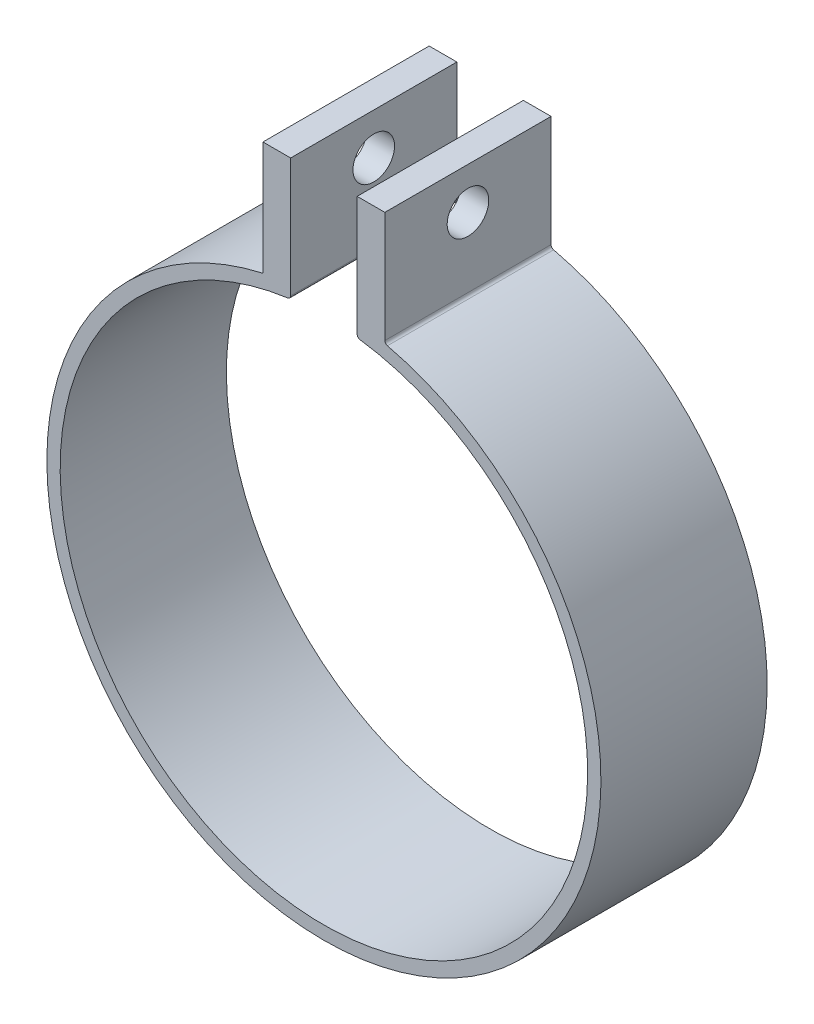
ISO-10303-21;
HEADER;
FILE_DESCRIPTION(('STEP AP214'),'2;1');
FILE_NAME('part.step','',(''),(''),'','','');
FILE_SCHEMA(('AUTOMOTIVE_DESIGN { 1 0 10303 214 1 1 1 1 }'));
ENDSEC;
DATA;
#1=APPLICATION_CONTEXT('core data for automotive mechanical design processes');
#2=APPLICATION_PROTOCOL_DEFINITION('international standard','automotive_design',2000,#1);
#3=PRODUCT_CONTEXT('',#1,'mechanical');
#4=PRODUCT('Part','Part','',(#3));
#5=PRODUCT_RELATED_PRODUCT_CATEGORY('part','',(#4));
#6=PRODUCT_DEFINITION_FORMATION('','',#4);
#7=PRODUCT_DEFINITION_CONTEXT('part definition',#1,'design');
#8=PRODUCT_DEFINITION('design','',#6,#7);
#9=PRODUCT_DEFINITION_SHAPE('','',#8);
#10=(LENGTH_UNIT() NAMED_UNIT(*) SI_UNIT(.MILLI.,.METRE.));
#11=(NAMED_UNIT(*) PLANE_ANGLE_UNIT() SI_UNIT($,.RADIAN.));
#12=(NAMED_UNIT(*) SI_UNIT($,.STERADIAN.) SOLID_ANGLE_UNIT());
#13=UNCERTAINTY_MEASURE_WITH_UNIT(LENGTH_MEASURE(1.E-05),#10,'distance_accuracy_value','');
#14=(GEOMETRIC_REPRESENTATION_CONTEXT(3) GLOBAL_UNCERTAINTY_ASSIGNED_CONTEXT((#13)) GLOBAL_UNIT_ASSIGNED_CONTEXT((#10,
#11,#12)) REPRESENTATION_CONTEXT('',''));
#15=CARTESIAN_POINT('',(0.,0.,0.));
#16=DIRECTION('',(0.,0.,1.));
#17=DIRECTION('',(1.,0.,0.));
#18=AXIS2_PLACEMENT_3D('',#15,#16,#17);
#19=CARTESIAN_POINT('',(7.62,88.0043253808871,38.1));
#20=DIRECTION('',(0.,-1.,0.));
#21=DIRECTION('',(0.,0.,-1.));
#22=AXIS2_PLACEMENT_3D('',#19,#20,#21);
#23=PLANE('',#22);
#24=DIRECTION('',(-1.,0.,0.));
#25=VECTOR('',#24,1.);
#26=CARTESIAN_POINT('',(7.62,88.0043253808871,0.));
#27=LINE('',#26,#25);
#28=CARTESIAN_POINT('',(13.97,88.0043253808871,0.));
#29=VERTEX_POINT('',#28);
#30=CARTESIAN_POINT('',(7.62,88.0043253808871,0.));
#31=VERTEX_POINT('',#30);
#32=EDGE_CURVE('E117',#29,#31,#27,.T.);
#33=ORIENTED_EDGE('',*,*,#32,.T.);
#34=DIRECTION('',(0.,0.,-1.));
#35=VECTOR('',#34,1.);
#36=CARTESIAN_POINT('',(7.62,88.0043253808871,38.1));
#37=LINE('',#36,#35);
#38=CARTESIAN_POINT('',(7.62,88.0043253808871,38.1));
#39=VERTEX_POINT('',#38);
#40=EDGE_CURVE('E11',#39,#31,#37,.T.);
#41=ORIENTED_EDGE('',*,*,#40,.F.);
#42=DIRECTION('',(-1.,0.,0.));
#43=VECTOR('',#42,1.);
#44=CARTESIAN_POINT('',(7.62,88.0043253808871,38.1));
#45=LINE('',#44,#43);
#46=CARTESIAN_POINT('',(13.97,88.0043253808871,38.1));
#47=VERTEX_POINT('',#46);
#48=EDGE_CURVE('E155',#47,#39,#45,.T.);
#49=ORIENTED_EDGE('',*,*,#48,.F.);
#50=DIRECTION('',(0.,0.,-1.));
#51=VECTOR('',#50,1.);
#52=CARTESIAN_POINT('',(13.97,88.0043253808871,38.1));
#53=LINE('',#52,#51);
#54=EDGE_CURVE('E130',#47,#29,#53,.T.);
#55=ORIENTED_EDGE('',*,*,#54,.T.);
#56=EDGE_LOOP('',(#33,#41,#49,#55));
#57=FACE_BOUND('',#56,.T.);
#58=ADVANCED_FACE('F30',(#57),#23,.F.);
#59=CARTESIAN_POINT('',(7.62,60.6374131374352,38.1));
#60=DIRECTION('',(1.,0.,0.));
#61=DIRECTION('',(0.,1.,0.));
#62=AXIS2_PLACEMENT_3D('',#59,#60,#61);
#63=PLANE('',#62);
#64=CARTESIAN_POINT('',(7.62,78.4793253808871,19.05));
#65=DIRECTION('',(1.,0.,0.));
#66=DIRECTION('',(0.,1.,0.));
#67=AXIS2_PLACEMENT_3D('',#64,#65,#66);
#68=CIRCLE('',#67,4.7625);
#69=CARTESIAN_POINT('',(7.62,83.2418253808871,19.05));
#70=VERTEX_POINT('',#69);
#71=EDGE_CURVE('E131',#70,#70,#68,.T.);
#72=ORIENTED_EDGE('',*,*,#71,.T.);
#73=EDGE_LOOP('',(#72));
#74=FACE_BOUND('',#73,.T.);
#75=DIRECTION('',(0.,-1.,0.));
#76=VECTOR('',#75,1.);
#77=CARTESIAN_POINT('',(7.62,60.6374131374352,0.));
#78=LINE('',#77,#76);
#79=CARTESIAN_POINT('',(7.62,60.6374131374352,0.));
#80=VERTEX_POINT('',#79);
#81=EDGE_CURVE('E113',#31,#80,#78,.T.);
#82=ORIENTED_EDGE('',*,*,#81,.T.);
#83=DIRECTION('',(0.,0.,-1.));
#84=VECTOR('',#83,1.);
#85=CARTESIAN_POINT('',(7.62,60.6374131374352,38.1));
#86=LINE('',#85,#84);
#87=CARTESIAN_POINT('',(7.62,60.6374131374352,38.1));
#88=VERTEX_POINT('',#87);
#89=EDGE_CURVE('E38',#88,#80,#86,.T.);
#90=ORIENTED_EDGE('',*,*,#89,.F.);
#91=DIRECTION('',(0.,-1.,0.));
#92=VECTOR('',#91,1.);
#93=CARTESIAN_POINT('',(7.62,60.6374131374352,38.1));
#94=LINE('',#93,#92);
#95=EDGE_CURVE('E126',#39,#88,#94,.T.);
#96=ORIENTED_EDGE('',*,*,#95,.F.);
#97=ORIENTED_EDGE('',*,*,#40,.T.);
#98=EDGE_LOOP('',(#82,#90,#96,#97));
#99=FACE_BOUND('',#98,.T.);
#100=ADVANCED_FACE('F125',(#74,#99),#63,.F.);
#101=CARTESIAN_POINT('',(8.382,60.6374131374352,38.1));
#102=DIRECTION('',(0.,0.,-1.));
#103=DIRECTION('',(-1.,0.,0.));
#104=AXIS2_PLACEMENT_3D('',#101,#102,#103);
#105=CYLINDRICAL_SURFACE('',#104,0.761999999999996);
#106=CARTESIAN_POINT('',(8.382,60.6374131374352,0.));
#107=DIRECTION('',(0.,0.,1.));
#108=DIRECTION('',(-1.,0.,0.));
#109=AXIS2_PLACEMENT_3D('',#106,#107,#108);
#110=CIRCLE('',#109,0.761999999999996);
#111=CARTESIAN_POINT('',(8.27765975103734,59.8825905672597,0.));
#112=VERTEX_POINT('',#111);
#113=EDGE_CURVE('E119',#80,#112,#110,.T.);
#114=ORIENTED_EDGE('',*,*,#113,.T.);
#115=DIRECTION('',(0.,0.,-1.));
#116=VECTOR('',#115,1.);
#117=CARTESIAN_POINT('',(8.27765975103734,59.8825905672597,38.1));
#118=LINE('',#117,#116);
#119=CARTESIAN_POINT('',(8.27765975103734,59.8825905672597,38.1));
#120=VERTEX_POINT('',#119);
#121=EDGE_CURVE('E196',#120,#112,#118,.T.);
#122=ORIENTED_EDGE('',*,*,#121,.F.);
#123=CARTESIAN_POINT('',(8.382,60.6374131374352,38.1));
#124=DIRECTION('',(0.,0.,1.));
#125=DIRECTION('',(-1.,0.,0.));
#126=AXIS2_PLACEMENT_3D('',#123,#124,#125);
#127=CIRCLE('',#126,0.761999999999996);
#128=EDGE_CURVE('E158',#88,#120,#127,.T.);
#129=ORIENTED_EDGE('',*,*,#128,.F.);
#130=ORIENTED_EDGE('',*,*,#89,.T.);
#131=EDGE_LOOP('',(#114,#122,#129,#130));
#132=FACE_BOUND('',#131,.T.);
#133=ADVANCED_FACE('F201',(#132),#105,.T.);
#134=CARTESIAN_POINT('',(0.,0.,38.1));
#135=DIRECTION('',(0.,0.,-1.));
#136=DIRECTION('',(-1.,0.,0.));
#137=AXIS2_PLACEMENT_3D('',#134,#135,#136);
#138=CYLINDRICAL_SURFACE('',#137,60.452);
#139=CARTESIAN_POINT('',(0.,0.,0.));
#140=DIRECTION('',(0.,0.,-1.));
#141=DIRECTION('',(1.,0.,0.));
#142=AXIS2_PLACEMENT_3D('',#139,#140,#141);
#143=CIRCLE('',#142,60.452);
#144=CARTESIAN_POINT('',(-8.27765975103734,59.8825905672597,0.));
#145=VERTEX_POINT('',#144);
#146=EDGE_CURVE('E139',#112,#145,#143,.T.);
#147=ORIENTED_EDGE('',*,*,#146,.T.);
#148=DIRECTION('',(0.,0.,-1.));
#149=VECTOR('',#148,1.);
#150=CARTESIAN_POINT('',(-8.27765975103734,59.8825905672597,38.1));
#151=LINE('',#150,#149);
#152=CARTESIAN_POINT('',(-8.27765975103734,59.8825905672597,38.1));
#153=VERTEX_POINT('',#152);
#154=EDGE_CURVE('E193',#153,#145,#151,.T.);
#155=ORIENTED_EDGE('',*,*,#154,.F.);
#156=CARTESIAN_POINT('',(0.,0.,38.1));
#157=DIRECTION('',(0.,0.,-1.));
#158=DIRECTION('',(1.,0.,0.));
#159=AXIS2_PLACEMENT_3D('',#156,#157,#158);
#160=CIRCLE('',#159,60.452);
#161=EDGE_CURVE('E160',#120,#153,#160,.T.);
#162=ORIENTED_EDGE('',*,*,#161,.F.);
#163=ORIENTED_EDGE('',*,*,#121,.T.);
#164=EDGE_LOOP('',(#147,#155,#162,#163));
#165=FACE_BOUND('',#164,.T.);
#166=ADVANCED_FACE('F209',(#165),#138,.F.);
#167=CARTESIAN_POINT('',(-8.382,60.6374131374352,38.1));
#168=DIRECTION('',(0.,0.,-1.));
#169=DIRECTION('',(-1.,0.,0.));
#170=AXIS2_PLACEMENT_3D('',#167,#168,#169);
#171=CYLINDRICAL_SURFACE('',#170,0.761999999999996);
#172=CARTESIAN_POINT('',(-8.382,60.6374131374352,0.));
#173=DIRECTION('',(0.,0.,1.));
#174=DIRECTION('',(-1.,0.,0.));
#175=AXIS2_PLACEMENT_3D('',#172,#173,#174);
#176=CIRCLE('',#175,0.761999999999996);
#177=CARTESIAN_POINT('',(-7.62,60.6374131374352,0.));
#178=VERTEX_POINT('',#177);
#179=EDGE_CURVE('E141',#145,#178,#176,.T.);
#180=ORIENTED_EDGE('',*,*,#179,.T.);
#181=DIRECTION('',(0.,0.,-1.));
#182=VECTOR('',#181,1.);
#183=CARTESIAN_POINT('',(-7.62,60.6374131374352,38.1));
#184=LINE('',#183,#182);
#185=CARTESIAN_POINT('',(-7.62,60.6374131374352,38.1));
#186=VERTEX_POINT('',#185);
#187=EDGE_CURVE('E190',#186,#178,#184,.T.);
#188=ORIENTED_EDGE('',*,*,#187,.F.);
#189=CARTESIAN_POINT('',(-8.382,60.6374131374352,38.1));
#190=DIRECTION('',(0.,0.,1.));
#191=DIRECTION('',(-1.,0.,0.));
#192=AXIS2_PLACEMENT_3D('',#189,#190,#191);
#193=CIRCLE('',#192,0.761999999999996);
#194=EDGE_CURVE('E162',#153,#186,#193,.T.);
#195=ORIENTED_EDGE('',*,*,#194,.F.);
#196=ORIENTED_EDGE('',*,*,#154,.T.);
#197=EDGE_LOOP('',(#180,#188,#195,#196));
#198=FACE_BOUND('',#197,.T.);
#199=ADVANCED_FACE('F212',(#198),#171,.T.);
#200=CARTESIAN_POINT('',(-7.62,60.6374131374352,38.1));
#201=DIRECTION('',(-1.,0.,0.));
#202=DIRECTION('',(0.,-1.,0.));
#203=AXIS2_PLACEMENT_3D('',#200,#201,#202);
#204=PLANE('',#203);
#205=CARTESIAN_POINT('',(-7.62,78.4793253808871,19.05));
#206=DIRECTION('',(-1.,0.,0.));
#207=DIRECTION('',(0.,-1.,0.));
#208=AXIS2_PLACEMENT_3D('',#205,#206,#207);
#209=CIRCLE('',#208,4.7625);
#210=CARTESIAN_POINT('',(-7.62,73.7168253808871,19.05));
#211=VERTEX_POINT('',#210);
#212=EDGE_CURVE('E134',#211,#211,#209,.T.);
#213=ORIENTED_EDGE('',*,*,#212,.T.);
#214=EDGE_LOOP('',(#213));
#215=FACE_BOUND('',#214,.T.);
#216=DIRECTION('',(0.,1.,0.));
#217=VECTOR('',#216,1.);
#218=CARTESIAN_POINT('',(-7.62,60.6374131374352,0.));
#219=LINE('',#218,#217);
#220=CARTESIAN_POINT('',(-7.62,88.0043253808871,0.));
#221=VERTEX_POINT('',#220);
#222=EDGE_CURVE('E143',#178,#221,#219,.T.);
#223=ORIENTED_EDGE('',*,*,#222,.T.);
#224=DIRECTION('',(0.,0.,-1.));
#225=VECTOR('',#224,1.);
#226=CARTESIAN_POINT('',(-7.62,88.0043253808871,38.1));
#227=LINE('',#226,#225);
#228=CARTESIAN_POINT('',(-7.62,88.0043253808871,38.1));
#229=VERTEX_POINT('',#228);
#230=EDGE_CURVE('E187',#229,#221,#227,.T.);
#231=ORIENTED_EDGE('',*,*,#230,.F.);
#232=DIRECTION('',(0.,1.,0.));
#233=VECTOR('',#232,1.);
#234=CARTESIAN_POINT('',(-7.62,60.6374131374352,38.1));
#235=LINE('',#234,#233);
#236=EDGE_CURVE('E164',#186,#229,#235,.T.);
#237=ORIENTED_EDGE('',*,*,#236,.F.);
#238=ORIENTED_EDGE('',*,*,#187,.T.);
#239=EDGE_LOOP('',(#223,#231,#237,#238));
#240=FACE_BOUND('',#239,.T.);
#241=ADVANCED_FACE('F217',(#215,#240),#204,.F.);
#242=CARTESIAN_POINT('',(-13.97,88.0043253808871,38.1));
#243=DIRECTION('',(0.,-1.,0.));
#244=DIRECTION('',(0.,0.,-1.));
#245=AXIS2_PLACEMENT_3D('',#242,#243,#244);
#246=PLANE('',#245);
#247=DIRECTION('',(-1.,0.,0.));
#248=VECTOR('',#247,1.);
#249=CARTESIAN_POINT('',(-13.97,88.0043253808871,0.));
#250=LINE('',#249,#248);
#251=CARTESIAN_POINT('',(-13.97,88.0043253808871,0.));
#252=VERTEX_POINT('',#251);
#253=EDGE_CURVE('E145',#221,#252,#250,.T.);
#254=ORIENTED_EDGE('',*,*,#253,.T.);
#255=DIRECTION('',(0.,0.,-1.));
#256=VECTOR('',#255,1.);
#257=CARTESIAN_POINT('',(-13.97,88.0043253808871,38.1));
#258=LINE('',#257,#256);
#259=CARTESIAN_POINT('',(-13.97,88.0043253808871,38.1));
#260=VERTEX_POINT('',#259);
#261=EDGE_CURVE('E184',#260,#252,#258,.T.);
#262=ORIENTED_EDGE('',*,*,#261,.F.);
#263=DIRECTION('',(-1.,0.,0.));
#264=VECTOR('',#263,1.);
#265=CARTESIAN_POINT('',(-13.97,88.0043253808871,38.1));
#266=LINE('',#265,#264);
#267=EDGE_CURVE('E166',#229,#260,#266,.T.);
#268=ORIENTED_EDGE('',*,*,#267,.F.);
#269=ORIENTED_EDGE('',*,*,#230,.T.);
#270=EDGE_LOOP('',(#254,#262,#268,#269));
#271=FACE_BOUND('',#270,.T.);
#272=ADVANCED_FACE('F223',(#271),#246,.F.);
#273=CARTESIAN_POINT('',(-13.97,61.9442418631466,38.1));
#274=DIRECTION('',(1.,0.,0.));
#275=DIRECTION('',(0.,0.,-1.));
#276=AXIS2_PLACEMENT_3D('',#273,#274,#275);
#277=PLANE('',#276);
#278=CARTESIAN_POINT('',(-13.97,78.4793253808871,19.05));
#279=DIRECTION('',(-1.,0.,0.));
#280=DIRECTION('',(0.,0.,1.));
#281=AXIS2_PLACEMENT_3D('',#278,#279,#280);
#282=CIRCLE('',#281,4.7625);
#283=CARTESIAN_POINT('',(-13.97,78.4793253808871,23.8125));
#284=VERTEX_POINT('',#283);
#285=EDGE_CURVE('E367',#284,#284,#282,.T.);
#286=ORIENTED_EDGE('',*,*,#285,.F.);
#287=EDGE_LOOP('',(#286));
#288=FACE_BOUND('',#287,.T.);
#289=DIRECTION('',(0.,-1.,0.));
#290=VECTOR('',#289,1.);
#291=CARTESIAN_POINT('',(-13.97,61.9442418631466,0.));
#292=LINE('',#291,#290);
#293=CARTESIAN_POINT('',(-13.97,61.9442418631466,0.));
#294=VERTEX_POINT('',#293);
#295=EDGE_CURVE('E147',#252,#294,#292,.T.);
#296=ORIENTED_EDGE('',*,*,#295,.T.);
#297=DIRECTION('',(0.,0.,-1.));
#298=VECTOR('',#297,1.);
#299=CARTESIAN_POINT('',(-13.97,61.9442418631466,38.1));
#300=LINE('',#299,#298);
#301=CARTESIAN_POINT('',(-13.97,61.9442418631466,38.1));
#302=VERTEX_POINT('',#301);
#303=EDGE_CURVE('E181',#302,#294,#300,.T.);
#304=ORIENTED_EDGE('',*,*,#303,.F.);
#305=DIRECTION('',(0.,-1.,0.));
#306=VECTOR('',#305,1.);
#307=CARTESIAN_POINT('',(-13.97,61.9442418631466,38.1));
#308=LINE('',#307,#306);
#309=EDGE_CURVE('E168',#260,#302,#308,.T.);
#310=ORIENTED_EDGE('',*,*,#309,.F.);
#311=ORIENTED_EDGE('',*,*,#261,.T.);
#312=EDGE_LOOP('',(#296,#304,#310,#311));
#313=FACE_BOUND('',#312,.T.);
#314=ADVANCED_FACE('F227',(#288,#313),#277,.F.);
#315=CARTESIAN_POINT('',(0.,0.,38.1));
#316=DIRECTION('',(0.,0.,-1.));
#317=DIRECTION('',(-1.,0.,0.));
#318=AXIS2_PLACEMENT_3D('',#315,#316,#317);
#319=CYLINDRICAL_SURFACE('',#318,63.5);
#320=CARTESIAN_POINT('',(0.,0.,0.));
#321=DIRECTION('',(0.,0.,1.));
#322=DIRECTION('',(1.,0.,0.));
#323=AXIS2_PLACEMENT_3D('',#320,#321,#322);
#324=CIRCLE('',#323,63.5);
#325=CARTESIAN_POINT('',(14.5573122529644,61.8088558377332,0.));
#326=VERTEX_POINT('',#325);
#327=EDGE_CURVE('E149',#294,#326,#324,.T.);
#328=ORIENTED_EDGE('',*,*,#327,.T.);
#329=DIRECTION('',(0.,0.,-1.));
#330=VECTOR('',#329,1.);
#331=CARTESIAN_POINT('',(14.5573122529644,61.8088558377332,38.1));
#332=LINE('',#331,#330);
#333=CARTESIAN_POINT('',(14.5573122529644,61.8088558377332,38.1));
#334=VERTEX_POINT('',#333);
#335=EDGE_CURVE('E178',#334,#326,#332,.T.);
#336=ORIENTED_EDGE('',*,*,#335,.F.);
#337=CARTESIAN_POINT('',(0.,0.,38.1));
#338=DIRECTION('',(0.,0.,1.));
#339=DIRECTION('',(1.,0.,0.));
#340=AXIS2_PLACEMENT_3D('',#337,#338,#339);
#341=CIRCLE('',#340,63.5);
#342=EDGE_CURVE('E170',#302,#334,#341,.T.);
#343=ORIENTED_EDGE('',*,*,#342,.F.);
#344=ORIENTED_EDGE('',*,*,#303,.T.);
#345=EDGE_LOOP('',(#328,#336,#343,#344));
#346=FACE_BOUND('',#345,.T.);
#347=ADVANCED_FACE('F232',(#346),#319,.T.);
#348=CARTESIAN_POINT('',(14.732,62.550562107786,38.1));
#349=DIRECTION('',(0.,0.,-1.));
#350=DIRECTION('',(-1.,0.,0.));
#351=AXIS2_PLACEMENT_3D('',#348,#349,#350);
#352=CYLINDRICAL_SURFACE('',#351,0.762000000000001);
#353=CARTESIAN_POINT('',(14.732,62.550562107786,0.));
#354=DIRECTION('',(0.,0.,-1.));
#355=DIRECTION('',(-1.,0.,0.));
#356=AXIS2_PLACEMENT_3D('',#353,#354,#355);
#357=CIRCLE('',#356,0.762000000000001);
#358=CARTESIAN_POINT('',(13.97,62.550562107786,0.));
#359=VERTEX_POINT('',#358);
#360=EDGE_CURVE('E151',#326,#359,#357,.T.);
#361=ORIENTED_EDGE('',*,*,#360,.T.);
#362=DIRECTION('',(0.,0.,-1.));
#363=VECTOR('',#362,1.);
#364=CARTESIAN_POINT('',(13.97,62.550562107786,38.1));
#365=LINE('',#364,#363);
#366=CARTESIAN_POINT('',(13.97,62.550562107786,38.1));
#367=VERTEX_POINT('',#366);
#368=EDGE_CURVE('E175',#367,#359,#365,.T.);
#369=ORIENTED_EDGE('',*,*,#368,.F.);
#370=CARTESIAN_POINT('',(14.732,62.550562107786,38.1));
#371=DIRECTION('',(0.,0.,-1.));
#372=DIRECTION('',(-1.,0.,0.));
#373=AXIS2_PLACEMENT_3D('',#370,#371,#372);
#374=CIRCLE('',#373,0.762000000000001);
#375=EDGE_CURVE('E50',#334,#367,#374,.T.);
#376=ORIENTED_EDGE('',*,*,#375,.F.);
#377=ORIENTED_EDGE('',*,*,#335,.T.);
#378=EDGE_LOOP('',(#361,#369,#376,#377));
#379=FACE_BOUND('',#378,.T.);
#380=ADVANCED_FACE('F235',(#379),#352,.F.);
#381=CARTESIAN_POINT('',(13.97,62.550562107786,38.1));
#382=DIRECTION('',(-1.,0.,0.));
#383=DIRECTION('',(0.,-1.,0.));
#384=AXIS2_PLACEMENT_3D('',#381,#382,#383);
#385=PLANE('',#384);
#386=CARTESIAN_POINT('',(13.97,78.4793253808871,19.05));
#387=DIRECTION('',(-1.,0.,0.));
#388=DIRECTION('',(0.,-1.,0.));
#389=AXIS2_PLACEMENT_3D('',#386,#387,#388);
#390=CIRCLE('',#389,4.7625);
#391=CARTESIAN_POINT('',(13.97,73.7168253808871,19.05));
#392=VERTEX_POINT('',#391);
#393=EDGE_CURVE('E33',#392,#392,#390,.T.);
#394=ORIENTED_EDGE('',*,*,#393,.T.);
#395=EDGE_LOOP('',(#394));
#396=FACE_BOUND('',#395,.T.);
#397=DIRECTION('',(0.,1.,0.));
#398=VECTOR('',#397,1.);
#399=CARTESIAN_POINT('',(13.97,62.550562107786,0.));
#400=LINE('',#399,#398);
#401=EDGE_CURVE('E153',#359,#29,#400,.T.);
#402=ORIENTED_EDGE('',*,*,#401,.T.);
#403=ORIENTED_EDGE('',*,*,#54,.F.);
#404=DIRECTION('',(0.,1.,0.));
#405=VECTOR('',#404,1.);
#406=CARTESIAN_POINT('',(13.97,62.550562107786,38.1));
#407=LINE('',#406,#405);
#408=EDGE_CURVE('E45',#367,#47,#407,.T.);
#409=ORIENTED_EDGE('',*,*,#408,.F.);
#410=ORIENTED_EDGE('',*,*,#368,.T.);
#411=EDGE_LOOP('',(#402,#403,#409,#410));
#412=FACE_BOUND('',#411,.T.);
#413=ADVANCED_FACE('F237',(#396,#412),#385,.F.);
#414=CARTESIAN_POINT('',(14.732,62.550562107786,38.1));
#415=DIRECTION('',(0.,0.,-1.));
#416=DIRECTION('',(-1.,0.,0.));
#417=AXIS2_PLACEMENT_3D('',#414,#415,#416);
#418=PLANE('',#417);
#419=ORIENTED_EDGE('',*,*,#48,.T.);
#420=ORIENTED_EDGE('',*,*,#95,.T.);
#421=ORIENTED_EDGE('',*,*,#128,.T.);
#422=ORIENTED_EDGE('',*,*,#161,.T.);
#423=ORIENTED_EDGE('',*,*,#194,.T.);
#424=ORIENTED_EDGE('',*,*,#236,.T.);
#425=ORIENTED_EDGE('',*,*,#267,.T.);
#426=ORIENTED_EDGE('',*,*,#309,.T.);
#427=ORIENTED_EDGE('',*,*,#342,.T.);
#428=ORIENTED_EDGE('',*,*,#375,.T.);
#429=ORIENTED_EDGE('',*,*,#408,.T.);
#430=EDGE_LOOP('',(#419,#420,#421,#422,#423,#424,#425,#426,#427,#428,#429));
#431=FACE_BOUND('',#430,.T.);
#432=ADVANCED_FACE('F204',(#431),#418,.F.);
#433=CARTESIAN_POINT('',(14.732,62.550562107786,0.));
#434=DIRECTION('',(0.,0.,-1.));
#435=DIRECTION('',(-1.,0.,0.));
#436=AXIS2_PLACEMENT_3D('',#433,#434,#435);
#437=PLANE('',#436);
#438=ORIENTED_EDGE('',*,*,#32,.F.);
#439=ORIENTED_EDGE('',*,*,#401,.F.);
#440=ORIENTED_EDGE('',*,*,#360,.F.);
#441=ORIENTED_EDGE('',*,*,#327,.F.);
#442=ORIENTED_EDGE('',*,*,#295,.F.);
#443=ORIENTED_EDGE('',*,*,#253,.F.);
#444=ORIENTED_EDGE('',*,*,#222,.F.);
#445=ORIENTED_EDGE('',*,*,#179,.F.);
#446=ORIENTED_EDGE('',*,*,#146,.F.);
#447=ORIENTED_EDGE('',*,*,#113,.F.);
#448=ORIENTED_EDGE('',*,*,#81,.F.);
#449=EDGE_LOOP('',(#438,#439,#440,#441,#442,#443,#444,#445,#446,#447,#448));
#450=FACE_BOUND('',#449,.T.);
#451=ADVANCED_FACE('F114',(#450),#437,.T.);
#452=CARTESIAN_POINT('',(63.5,78.4793253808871,19.05));
#453=DIRECTION('',(-1.,0.,0.));
#454=DIRECTION('',(0.,0.,1.));
#455=AXIS2_PLACEMENT_3D('',#452,#453,#454);
#456=CYLINDRICAL_SURFACE('',#455,4.7625);
#457=ORIENTED_EDGE('',*,*,#393,.F.);
#458=EDGE_LOOP('',(#457));
#459=FACE_BOUND('',#458,.T.);
#460=ORIENTED_EDGE('',*,*,#71,.F.);
#461=EDGE_LOOP('',(#460));
#462=FACE_BOUND('',#461,.T.);
#463=ADVANCED_FACE('F299',(#459,#462),#456,.F.);
#464=ORIENTED_EDGE('',*,*,#285,.T.);
#465=EDGE_LOOP('',(#464));
#466=FACE_BOUND('',#465,.T.);
#467=ORIENTED_EDGE('',*,*,#212,.F.);
#468=EDGE_LOOP('',(#467));
#469=FACE_BOUND('',#468,.T.);
#470=ADVANCED_FACE('F308',(#466,#469),#456,.F.);
#471=CLOSED_SHELL('',(#58,#100,#133,#166,#199,#241,#272,#314,#347,#380,#413,#432,#451,#463,#470));
#472=MANIFOLD_SOLID_BREP('B2',#471);
#473=ADVANCED_BREP_SHAPE_REPRESENTATION('',(#18,#472),#14);
#474=SHAPE_DEFINITION_REPRESENTATION(#9,#473);
ENDSEC;
END-ISO-10303-21;
